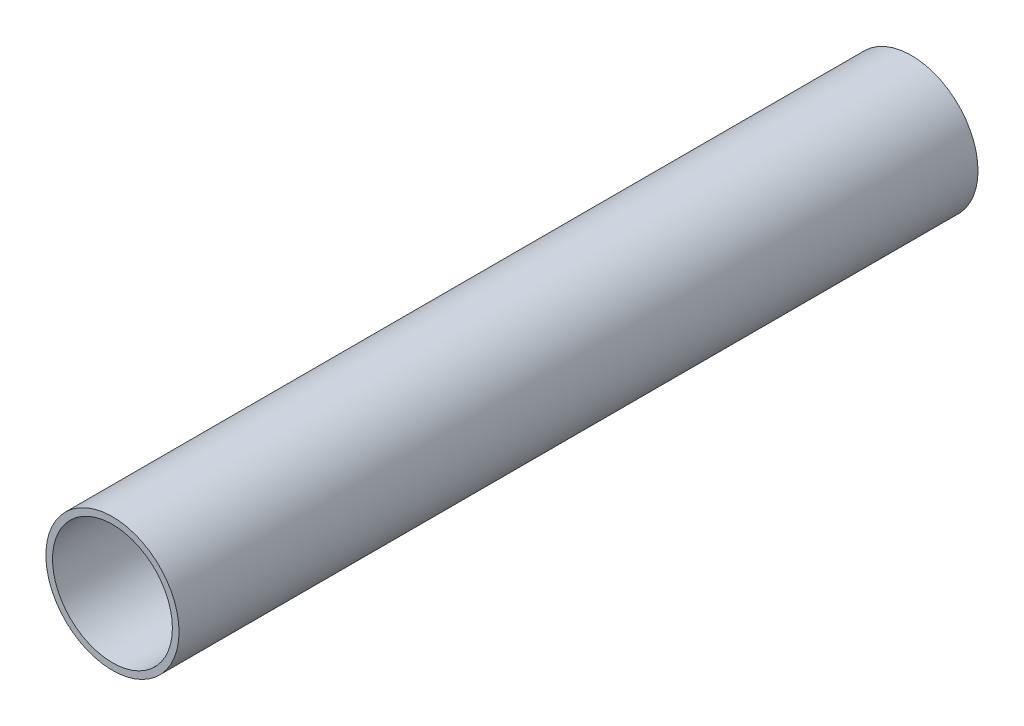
from build123d import *

# Parameters (mm, degrees)
BASE_EXTRUSION_DEPTH      = 30
BASE_EXTRUSION_DEPTH_BACK = 30
ESQUISSE1_R               = 5
ESQUISSE1_R_2             = 4.5


with BuildPart() as part:
    # Esquisse1 → Base-Extrusion (new, two sides: drawn at the far end of the back side and taken through both)
    with BuildSketch(Plane.XY.offset(-BASE_EXTRUSION_DEPTH_BACK)):
        Circle(ESQUISSE1_R)
        Circle(ESQUISSE1_R_2, mode=Mode.SUBTRACT)
    extrude(amount=BASE_EXTRUSION_DEPTH + BASE_EXTRUSION_DEPTH_BACK)


solid = part.part
